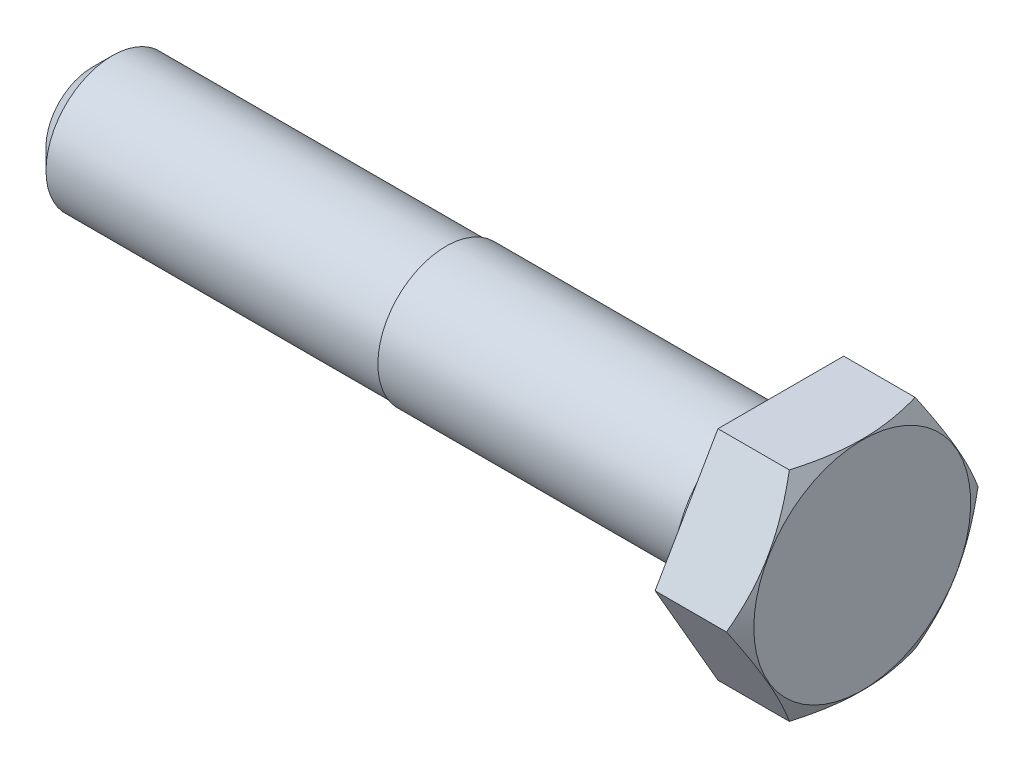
ISO-10303-21;
HEADER;
FILE_DESCRIPTION(('STEP AP214'),'2;1');
FILE_NAME('part.step','',(''),(''),'','','');
FILE_SCHEMA(('AUTOMOTIVE_DESIGN { 1 0 10303 214 1 1 1 1 }'));
ENDSEC;
DATA;
#1=APPLICATION_CONTEXT('core data for automotive mechanical design processes');
#2=APPLICATION_PROTOCOL_DEFINITION('international standard','automotive_design',2000,#1);
#3=PRODUCT_CONTEXT('',#1,'mechanical');
#4=PRODUCT('Part','Part','',(#3));
#5=PRODUCT_RELATED_PRODUCT_CATEGORY('part','',(#4));
#6=PRODUCT_DEFINITION_FORMATION('','',#4);
#7=PRODUCT_DEFINITION_CONTEXT('part definition',#1,'design');
#8=PRODUCT_DEFINITION('design','',#6,#7);
#9=PRODUCT_DEFINITION_SHAPE('','',#8);
#10=(LENGTH_UNIT() NAMED_UNIT(*) SI_UNIT(.MILLI.,.METRE.));
#11=(NAMED_UNIT(*) PLANE_ANGLE_UNIT() SI_UNIT($,.RADIAN.));
#12=(NAMED_UNIT(*) SI_UNIT($,.STERADIAN.) SOLID_ANGLE_UNIT());
#13=UNCERTAINTY_MEASURE_WITH_UNIT(LENGTH_MEASURE(1.E-05),#10,'distance_accuracy_value','');
#14=(GEOMETRIC_REPRESENTATION_CONTEXT(3) GLOBAL_UNCERTAINTY_ASSIGNED_CONTEXT((#13)) GLOBAL_UNIT_ASSIGNED_CONTEXT((#10,
#11,#12)) REPRESENTATION_CONTEXT('',''));
#15=CARTESIAN_POINT('',(0.,0.,0.));
#16=DIRECTION('',(0.,0.,1.));
#17=DIRECTION('',(1.,0.,0.));
#18=AXIS2_PLACEMENT_3D('',#15,#16,#17);
#19=CARTESIAN_POINT('',(6.58,0.,0.));
#20=DIRECTION('',(1.,0.,0.));
#21=DIRECTION('',(0.,0.,-1.));
#22=AXIS2_PLACEMENT_3D('',#19,#20,#21);
#23=PLANE('',#22);
#24=CARTESIAN_POINT('',(6.58000000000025,0.,0.));
#25=DIRECTION('',(-1.,0.,0.));
#26=DIRECTION('',(0.,0.,1.));
#27=AXIS2_PLACEMENT_3D('',#24,#25,#26);
#28=CIRCLE('',#27,7.96416127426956);
#29=CARTESIAN_POINT('',(6.58000000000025,0.,7.96416127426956));
#30=VERTEX_POINT('',#29);
#31=EDGE_CURVE('E85',#30,#30,#28,.T.);
#32=ORIENTED_EDGE('',*,*,#31,.F.);
#33=EDGE_LOOP('',(#32));
#34=FACE_BOUND('',#33,.T.);
#35=ADVANCED_FACE('F16',(#34),#23,.T.);
#36=CARTESIAN_POINT('',(5.84036598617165,0.,0.));
#37=DIRECTION('',(-1.,0.,0.));
#38=DIRECTION('',(0.,0.,1.));
#39=AXIS2_PLACEMENT_3D('',#36,#37,#38);
#40=CONICAL_SURFACE('',#39,9.24524496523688,1.0471975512);
#41=ORIENTED_EDGE('',*,*,#31,.T.);
#42=EDGE_LOOP('',(#41));
#43=FACE_BOUND('',#42,.T.);
#44=CARTESIAN_POINT('',(5.84477732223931,-1.71278036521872E-12,-9.23760430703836));
#45=CARTESIAN_POINT('',(5.94979165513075,-0.315055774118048,-9.05570677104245));
#46=CARTESIAN_POINT('',(6.04630304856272,-0.632460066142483,-8.87245331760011));
#47=CARTESIAN_POINT('',(6.21805198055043,-1.27221617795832,-8.50308995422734));
#48=CARTESIAN_POINT('',(6.29324487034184,-1.59457691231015,-8.31697489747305));
#49=CARTESIAN_POINT('',(6.41622401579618,-2.2359286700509,-7.946690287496));
#50=CARTESIAN_POINT('',(6.46458569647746,-2.5548337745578,-7.76257033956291));
#51=CARTESIAN_POINT('',(6.51588451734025,-3.03469904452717,-7.48551999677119));
#52=CARTESIAN_POINT('',(6.52944237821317,-3.19484385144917,-7.39306034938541));
#53=CARTESIAN_POINT('',(6.5492482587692,-3.51546832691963,-7.20794772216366));
#54=CARTESIAN_POINT('',(6.55549683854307,-3.67594796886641,-7.11529475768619));
#55=CARTESIAN_POINT('',(6.56075664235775,-4.0103014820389,-6.92225566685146));
#56=CARTESIAN_POINT('',(6.55912510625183,-4.18418310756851,-6.82186506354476));
#57=CARTESIAN_POINT('',(6.54717075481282,-4.53172322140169,-6.62121268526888));
#58=CARTESIAN_POINT('',(6.53684775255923,-4.70538170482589,-6.5209509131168));
#59=CARTESIAN_POINT('',(6.50774077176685,-5.05235452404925,-6.32062606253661));
#60=CARTESIAN_POINT('',(6.48894759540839,-5.22566827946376,-6.22056331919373));
#61=CARTESIAN_POINT('',(6.44332878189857,-5.57150185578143,-6.0208962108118));
#62=CARTESIAN_POINT('',(6.41650247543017,-5.74402160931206,-5.92129188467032));
#63=CARTESIAN_POINT('',(6.32328511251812,-6.26854051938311,-5.6184607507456));
#64=CARTESIAN_POINT('',(6.24490938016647,-6.61898300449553,-5.41613268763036));
#65=CARTESIAN_POINT('',(6.10811478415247,-7.14030011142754,-5.11515011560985));
#66=CARTESIAN_POINT('',(6.05937070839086,-7.31317449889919,-5.01534104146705));
#67=CARTESIAN_POINT('',(5.95617990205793,-7.65757214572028,-4.81650296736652));
#68=CARTESIAN_POINT('',(5.90173542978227,-7.82909591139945,-4.71747367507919));
#69=CARTESIAN_POINT('',(5.84477732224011,-8.00000000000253,-4.61880215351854));
#70=B_SPLINE_CURVE_WITH_KNOTS('',3,(#44,#45,#46,#47,#48,#49,#50,#51,#52,#53,#54,#55,#56,#57,#58,
#59,#60,#61,#62,#63,#64,#65,#66,#67,#68,#69),.UNSPECIFIED.,.F.,.F.,(4,2,2,2,2,2,2,2,2,2,2,2,4),
(0.,1.13620772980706,2.2747778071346,3.38787966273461,3.94400525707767,4.50008823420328,
5.10225977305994,5.70444426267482,6.30728424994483,6.910174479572,8.14546238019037,
8.76185434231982,9.37800302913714),.UNSPECIFIED.);
#71=CARTESIAN_POINT('',(5.84477732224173,-8.53704943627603E-13,-9.23760430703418));
#72=VERTEX_POINT('',#71);
#73=CARTESIAN_POINT('',(5.84477732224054,-8.,-4.61880215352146));
#74=VERTEX_POINT('',#73);
#75=EDGE_CURVE('E126',#72,#74,#70,.T.);
#76=ORIENTED_EDGE('',*,*,#75,.F.);
#77=CARTESIAN_POINT('',(5.84477732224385,7.99999999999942,-4.61880215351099));
#78=CARTESIAN_POINT('',(5.90338169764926,7.82415290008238,-4.72032752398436));
#79=CARTESIAN_POINT('',(5.95932618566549,7.64765018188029,-4.82223141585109));
#80=CARTESIAN_POINT('',(6.06516280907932,7.29321133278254,-5.02686678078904));
#81=CARTESIAN_POINT('',(6.11505233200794,7.11527461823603,-5.12959859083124));
#82=CARTESIAN_POINT('',(6.25465902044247,6.57861566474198,-5.43943878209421));
#83=CARTESIAN_POINT('',(6.33406438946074,6.21777505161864,-5.64777020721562));
#84=CARTESIAN_POINT('',(6.42717459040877,5.67778408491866,-5.95953413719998));
#85=CARTESIAN_POINT('',(6.45369860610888,5.50024680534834,-6.06203533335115));
#86=CARTESIAN_POINT('',(6.4981739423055,5.14436946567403,-6.2675012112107));
#87=CARTESIAN_POINT('',(6.51612602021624,4.96602947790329,-6.37046585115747));
#88=CARTESIAN_POINT('',(6.54300251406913,4.60904251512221,-6.57657237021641));
#89=CARTESIAN_POINT('',(6.55193717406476,4.43039611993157,-6.67971391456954));
#90=CARTESIAN_POINT('',(6.56058729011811,4.0729384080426,-6.88609222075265));
#91=CARTESIAN_POINT('',(6.56030303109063,3.89412709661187,-6.98932897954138));
#92=CARTESIAN_POINT('',(6.55115729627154,3.55984569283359,-7.18232643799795));
#93=CARTESIAN_POINT('',(6.54341147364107,3.40435198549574,-7.2721007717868));
#94=CARTESIAN_POINT('',(6.52109880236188,3.09372877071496,-7.45143916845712));
#95=CARTESIAN_POINT('',(6.50653149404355,2.93859928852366,-7.54100321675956));
#96=CARTESIAN_POINT('',(6.45294161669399,2.47381144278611,-7.80934860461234));
#97=CARTESIAN_POINT('',(6.40403778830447,2.16497575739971,-7.98765497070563));
#98=CARTESIAN_POINT('',(6.28177990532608,1.54402881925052,-8.34615885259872));
#99=CARTESIAN_POINT('',(6.20790770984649,1.23199679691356,-8.52631062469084));
#100=CARTESIAN_POINT('',(6.0402493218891,0.612585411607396,-8.88392795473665));
#101=CARTESIAN_POINT('',(5.94650249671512,0.3051981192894,-9.06139809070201));
#102=CARTESIAN_POINT('',(5.84477732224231,-5.49950815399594E-12,-9.23760430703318));
#103=B_SPLINE_CURVE_WITH_KNOTS('',3,(#77,#78,#79,#80,#81,#82,#83,#84,#85,#86,#87,#88,#89,#90,
#91,#92,#93,#94,#95,#96,#97,#98,#99,#100,#101,#102),.UNSPECIFIED.,.F.,.F.,(4,2,2,2,2,2,2,2,2,2,
2,2,4),(0.,0.633965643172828,1.26820385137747,2.5393150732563,3.15930423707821,3.77923860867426,
4.39846792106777,5.01767809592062,5.55669078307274,6.09573979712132,7.17460544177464,
8.27739515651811,9.37802056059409),.UNSPECIFIED.);
#104=CARTESIAN_POINT('',(5.84477732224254,7.99999999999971,-4.61880215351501));
#105=VERTEX_POINT('',#104);
#106=EDGE_CURVE('E81',#105,#72,#103,.T.);
#107=ORIENTED_EDGE('',*,*,#106,.F.);
#108=CARTESIAN_POINT('',(5.84477732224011,8.,4.61880215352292));
#109=CARTESIAN_POINT('',(5.90338169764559,8.,4.41575141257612));
#110=CARTESIAN_POINT('',(5.95932618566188,8.,4.21194362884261));
#111=CARTESIAN_POINT('',(6.06516280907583,8.,3.8026728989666));
#112=CARTESIAN_POINT('',(6.11505233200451,8.,3.59720927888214));
#113=CARTESIAN_POINT('',(6.25465902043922,8.,2.97752889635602));
#114=CARTESIAN_POINT('',(6.33406438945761,8.,2.56086604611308));
#115=CARTESIAN_POINT('',(6.4271745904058,8.,1.93733818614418));
#116=CARTESIAN_POINT('',(6.45369860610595,8.,1.73233579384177));
#117=CARTESIAN_POINT('',(6.49817394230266,8.,1.32140403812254));
#118=CARTESIAN_POINT('',(6.51612602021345,8.,1.11547475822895));
#119=CARTESIAN_POINT('',(6.54300251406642,8.,0.703261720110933));
#120=CARTESIAN_POINT('',(6.55193717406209,8.,0.496978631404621));
#121=CARTESIAN_POINT('',(6.5605872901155,8.,0.0842220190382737));
#122=CARTESIAN_POINT('',(6.56030303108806,8.,-0.12225149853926));
#123=CARTESIAN_POINT('',(6.55115729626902,8.,-0.508246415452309));
#124=CARTESIAN_POINT('',(6.54341147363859,8.,-0.687795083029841));
#125=CARTESIAN_POINT('',(6.52109880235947,8.,-1.04647187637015));
#126=CARTESIAN_POINT('',(6.50653149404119,8.,-1.22559997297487));
#127=CARTESIAN_POINT('',(6.45294161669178,8.,-1.76229074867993));
#128=CARTESIAN_POINT('',(6.40403778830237,8.,-2.11890348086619));
#129=CARTESIAN_POINT('',(6.28177990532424,8.,-2.83591124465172));
#130=CARTESIAN_POINT('',(6.2079077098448,8.,-3.19621478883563));
#131=CARTESIAN_POINT('',(6.04024932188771,8.,-3.91144944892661));
#132=CARTESIAN_POINT('',(5.94650249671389,8.,-4.26638972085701));
#133=CARTESIAN_POINT('',(5.84477732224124,8.,-4.61880215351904));
#134=B_SPLINE_CURVE_WITH_KNOTS('',3,(#108,#109,#110,#111,#112,#113,#114,#115,#116,#117,#118,
#119,#120,#121,#122,#123,#124,#125,#126,#127,#128,#129,#130,#131,#132,#133),.UNSPECIFIED.,.F.,
.F.,(4,2,2,2,2,2,2,2,2,2,2,2,4),(0.,0.633965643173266,1.26820385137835,2.53931507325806,
3.15930423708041,3.77923860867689,4.39846792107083,5.01767809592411,5.55669078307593,
6.09573979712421,7.17460544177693,8.27739515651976,9.3780205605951),.UNSPECIFIED.);
#135=CARTESIAN_POINT('',(5.84477732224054,8.,4.61880215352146));
#136=VERTEX_POINT('',#135);
#137=EDGE_CURVE('E74',#136,#105,#134,.T.);
#138=ORIENTED_EDGE('',*,*,#137,.F.);
#139=CARTESIAN_POINT('',(5.84477732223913,1.15719547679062E-12,9.23760430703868));
#140=CARTESIAN_POINT('',(5.94979165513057,0.315055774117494,9.05570677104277));
#141=CARTESIAN_POINT('',(6.04630304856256,0.632460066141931,8.87245331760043));
#142=CARTESIAN_POINT('',(6.2180519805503,1.27221617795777,8.50308995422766));
#143=CARTESIAN_POINT('',(6.29324487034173,1.59457691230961,8.31697489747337));
#144=CARTESIAN_POINT('',(6.41622401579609,2.23592867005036,7.94669028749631));
#145=CARTESIAN_POINT('',(6.46458569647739,2.55483377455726,7.76257033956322));
#146=CARTESIAN_POINT('',(6.5158845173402,3.03469904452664,7.4855199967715));
#147=CARTESIAN_POINT('',(6.52944237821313,3.19484385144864,7.39306034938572));
#148=CARTESIAN_POINT('',(6.54924825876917,3.51546832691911,7.20794772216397));
#149=CARTESIAN_POINT('',(6.55549683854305,3.67594796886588,7.1152947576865));
#150=CARTESIAN_POINT('',(6.56075664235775,4.0103014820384,6.92225566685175));
#151=CARTESIAN_POINT('',(6.55912510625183,4.18418310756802,6.82186506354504));
#152=CARTESIAN_POINT('',(6.54717075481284,4.53172322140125,6.62121268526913));
#153=CARTESIAN_POINT('',(6.53684775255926,4.70538170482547,6.52095091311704));
#154=CARTESIAN_POINT('',(6.50774077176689,5.05235452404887,6.32062606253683));
#155=CARTESIAN_POINT('',(6.48894759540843,5.2256682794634,6.22056331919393));
#156=CARTESIAN_POINT('',(6.44332878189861,5.57150185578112,6.02089621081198));
#157=CARTESIAN_POINT('',(6.41650247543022,5.74402160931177,5.92129188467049));
#158=CARTESIAN_POINT('',(6.32328511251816,6.26854051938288,5.61846075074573));
#159=CARTESIAN_POINT('',(6.24490938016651,6.61898300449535,5.41613268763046));
#160=CARTESIAN_POINT('',(6.1081147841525,7.14030011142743,5.11515011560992));
#161=CARTESIAN_POINT('',(6.05937070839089,7.31317449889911,5.0153410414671));
#162=CARTESIAN_POINT('',(5.95617990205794,7.65757214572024,4.81650296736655));
#163=CARTESIAN_POINT('',(5.90173542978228,7.82909591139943,4.7174736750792));
#164=CARTESIAN_POINT('',(5.84477732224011,8.00000000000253,4.61880215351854));
#165=B_SPLINE_CURVE_WITH_KNOTS('',3,(#139,#140,#141,#142,#143,#144,#145,#146,#147,#148,#149,
#150,#151,#152,#153,#154,#155,#156,#157,#158,#159,#160,#161,#162,#163,#164),.UNSPECIFIED.,.F.,
.F.,(4,2,2,2,2,2,2,2,2,2,2,2,4),(0.,1.13620772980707,2.27477780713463,3.38787966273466,
3.94400525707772,4.50008823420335,5.10225977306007,5.70444426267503,6.30728424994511,
6.91017447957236,8.14546238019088,8.76185434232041,9.37800302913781),.UNSPECIFIED.);
#166=CARTESIAN_POINT('',(5.84477732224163,5.7958640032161E-13,9.23760430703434));
#167=VERTEX_POINT('',#166);
#168=EDGE_CURVE('E78',#167,#136,#165,.T.);
#169=ORIENTED_EDGE('',*,*,#168,.F.);
#170=CARTESIAN_POINT('',(5.84477732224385,-7.99999999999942,4.61880215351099));
#171=CARTESIAN_POINT('',(5.90338169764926,-7.82415290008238,4.72032752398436));
#172=CARTESIAN_POINT('',(5.95932618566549,-7.64765018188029,4.82223141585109));
#173=CARTESIAN_POINT('',(6.06516280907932,-7.29321133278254,5.02686678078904));
#174=CARTESIAN_POINT('',(6.11505233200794,-7.11527461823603,5.12959859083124));
#175=CARTESIAN_POINT('',(6.25465902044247,-6.57861566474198,5.43943878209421));
#176=CARTESIAN_POINT('',(6.33406438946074,-6.21777505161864,5.64777020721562));
#177=CARTESIAN_POINT('',(6.42717459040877,-5.67778408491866,5.95953413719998));
#178=CARTESIAN_POINT('',(6.45369860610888,-5.50024680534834,6.06203533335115));
#179=CARTESIAN_POINT('',(6.4981739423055,-5.14436946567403,6.2675012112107));
#180=CARTESIAN_POINT('',(6.51612602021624,-4.96602947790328,6.37046585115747));
#181=CARTESIAN_POINT('',(6.54300251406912,-4.60904251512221,6.57657237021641));
#182=CARTESIAN_POINT('',(6.55193717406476,-4.43039611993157,6.67971391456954));
#183=CARTESIAN_POINT('',(6.56058729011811,-4.0729384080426,6.88609222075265));
#184=CARTESIAN_POINT('',(6.56030303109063,-3.89412709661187,6.98932897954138));
#185=CARTESIAN_POINT('',(6.55115729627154,-3.55984569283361,7.18232643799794));
#186=CARTESIAN_POINT('',(6.54341147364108,-3.40435198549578,7.27210077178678));
#187=CARTESIAN_POINT('',(6.52109880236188,-3.09372877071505,7.45143916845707));
#188=CARTESIAN_POINT('',(6.50653149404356,-2.93859928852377,7.5410032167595));
#189=CARTESIAN_POINT('',(6.45294161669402,-2.4738114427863,7.80934860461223));
#190=CARTESIAN_POINT('',(6.40403778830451,-2.16497575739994,7.9876549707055));
#191=CARTESIAN_POINT('',(6.28177990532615,-1.54402881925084,8.34615885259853));
#192=CARTESIAN_POINT('',(6.20790770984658,-1.23199679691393,8.52631062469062));
#193=CARTESIAN_POINT('',(6.04024932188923,-0.612585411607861,8.88392795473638));
#194=CARTESIAN_POINT('',(5.94650249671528,-0.305198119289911,9.06139809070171));
#195=CARTESIAN_POINT('',(5.84477732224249,4.94435617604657E-12,9.23760430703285));
#196=B_SPLINE_CURVE_WITH_KNOTS('',3,(#170,#171,#172,#173,#174,#175,#176,#177,#178,#179,#180,
#181,#182,#183,#184,#185,#186,#187,#188,#189,#190,#191,#192,#193,#194,#195),.UNSPECIFIED.,.F.,
.F.,(4,2,2,2,2,2,2,2,2,2,2,2,4),(0.,0.633965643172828,1.26820385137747,2.5393150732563,
3.15930423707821,3.77923860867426,4.39846792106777,5.01767809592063,5.55669078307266,
6.09573979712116,7.17460544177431,8.27739515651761,9.37802056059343),.UNSPECIFIED.);
#197=CARTESIAN_POINT('',(5.8447773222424,-7.99999999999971,4.6188021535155));
#198=VERTEX_POINT('',#197);
#199=EDGE_CURVE('E99',#198,#167,#196,.T.);
#200=ORIENTED_EDGE('',*,*,#199,.F.);
#201=CARTESIAN_POINT('',(5.84477732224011,-8.,-4.61880215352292));
#202=CARTESIAN_POINT('',(5.90338169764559,-8.,-4.41575141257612));
#203=CARTESIAN_POINT('',(5.95932618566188,-8.,-4.21194362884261));
#204=CARTESIAN_POINT('',(6.06516280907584,-8.,-3.8026728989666));
#205=CARTESIAN_POINT('',(6.11505233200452,-8.,-3.59720927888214));
#206=CARTESIAN_POINT('',(6.25465902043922,-8.,-2.97752889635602));
#207=CARTESIAN_POINT('',(6.33406438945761,-8.,-2.56086604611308));
#208=CARTESIAN_POINT('',(6.4271745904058,-8.,-1.93733818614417));
#209=CARTESIAN_POINT('',(6.45369860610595,-8.,-1.73233579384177));
#210=CARTESIAN_POINT('',(6.49817394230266,-8.,-1.32140403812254));
#211=CARTESIAN_POINT('',(6.51612602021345,-8.,-1.11547475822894));
#212=CARTESIAN_POINT('',(6.54300251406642,-8.,-0.703261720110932));
#213=CARTESIAN_POINT('',(6.55193717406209,-8.,-0.49697863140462));
#214=CARTESIAN_POINT('',(6.5605872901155,-8.,-0.0842220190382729));
#215=CARTESIAN_POINT('',(6.56030303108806,-8.,0.122251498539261));
#216=CARTESIAN_POINT('',(6.55115729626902,-8.,0.508246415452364));
#217=CARTESIAN_POINT('',(6.54341147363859,-8.,0.687795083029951));
#218=CARTESIAN_POINT('',(6.52109880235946,-8.,1.04647187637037));
#219=CARTESIAN_POINT('',(6.50653149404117,-8.,1.22559997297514));
#220=CARTESIAN_POINT('',(6.45294161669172,-8.,1.76229074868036));
#221=CARTESIAN_POINT('',(6.4040377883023,-8.,2.11890348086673));
#222=CARTESIAN_POINT('',(6.2817799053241,-8.,2.83591124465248));
#223=CARTESIAN_POINT('',(6.20790770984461,-8.,3.1962147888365));
#224=CARTESIAN_POINT('',(6.04024932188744,-8.,3.9114494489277));
#225=CARTESIAN_POINT('',(5.94650249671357,-8.,4.2663897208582));
#226=CARTESIAN_POINT('',(5.84477732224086,-8.,4.61880215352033));
#227=B_SPLINE_CURVE_WITH_KNOTS('',3,(#201,#202,#203,#204,#205,#206,#207,#208,#209,#210,#211,
#212,#213,#214,#215,#216,#217,#218,#219,#220,#221,#222,#223,#224,#225,#226),.UNSPECIFIED.,.F.,
.F.,(4,2,2,2,2,2,2,2,2,2,2,2,4),(0.,0.633965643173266,1.26820385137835,2.53931507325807,
3.15930423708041,3.77923860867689,4.39846792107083,5.01767809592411,5.55669078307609,
6.09573979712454,7.17460544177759,8.27739515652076,9.37802056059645),.UNSPECIFIED.);
#228=EDGE_CURVE('E133',#74,#198,#227,.T.);
#229=ORIENTED_EDGE('',*,*,#228,.F.);
#230=EDGE_LOOP('',(#76,#107,#138,#169,#200,#229));
#231=FACE_BOUND('',#230,.T.);
#232=ADVANCED_FACE('F76',(#43,#231),#40,.T.);
#233=CARTESIAN_POINT('',(0.6,8.,-4.61880215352));
#234=DIRECTION('',(0.,1.,0.));
#235=DIRECTION('',(0.,0.,1.));
#236=AXIS2_PLACEMENT_3D('',#233,#234,#235);
#237=PLANE('',#236);
#238=DIRECTION('',(1.,0.,0.));
#239=VECTOR('',#238,1.);
#240=CARTESIAN_POINT('',(0.6,8.,4.61880215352));
#241=LINE('',#240,#239);
#242=CARTESIAN_POINT('',(0.6,8.,4.61880215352));
#243=VERTEX_POINT('',#242);
#244=EDGE_CURVE('E84',#136,#243,#241,.F.);
#245=ORIENTED_EDGE('',*,*,#244,.F.);
#246=ORIENTED_EDGE('',*,*,#137,.T.);
#247=DIRECTION('',(1.,0.,0.));
#248=VECTOR('',#247,1.);
#249=CARTESIAN_POINT('',(0.6,7.99999999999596,-4.61880215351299));
#250=LINE('',#249,#248);
#251=CARTESIAN_POINT('',(0.6,7.99999999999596,-4.61880215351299));
#252=VERTEX_POINT('',#251);
#253=EDGE_CURVE('E143',#252,#105,#250,.T.);
#254=ORIENTED_EDGE('',*,*,#253,.F.);
#255=DIRECTION('',(0.,0.,-1.));
#256=VECTOR('',#255,1.);
#257=CARTESIAN_POINT('',(0.6,8.,0.));
#258=LINE('',#257,#256);
#259=EDGE_CURVE('E90',#252,#243,#258,.F.);
#260=ORIENTED_EDGE('',*,*,#259,.T.);
#261=EDGE_LOOP('',(#245,#246,#254,#260));
#262=FACE_BOUND('',#261,.T.);
#263=ADVANCED_FACE('F88',(#262),#237,.T.);
#264=CARTESIAN_POINT('',(0.6,8.,4.61880215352));
#265=DIRECTION('',(0.,0.50000000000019,0.866025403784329));
#266=DIRECTION('',(0.,-0.866025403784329,0.50000000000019));
#267=AXIS2_PLACEMENT_3D('',#264,#265,#266);
#268=PLANE('',#267);
#269=DIRECTION('',(1.,0.,0.));
#270=VECTOR('',#269,1.);
#271=CARTESIAN_POINT('',(0.6,0.,9.23760430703));
#272=LINE('',#271,#270);
#273=CARTESIAN_POINT('',(0.6,1.51894184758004E-12,9.23760430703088));
#274=VERTEX_POINT('',#273);
#275=EDGE_CURVE('E96',#167,#274,#272,.F.);
#276=ORIENTED_EDGE('',*,*,#275,.F.);
#277=ORIENTED_EDGE('',*,*,#168,.T.);
#278=ORIENTED_EDGE('',*,*,#244,.T.);
#279=DIRECTION('',(0.,-0.866025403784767,0.499999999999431));
#280=VECTOR('',#279,1.);
#281=CARTESIAN_POINT('',(0.6,8.,4.61880215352));
#282=LINE('',#281,#280);
#283=EDGE_CURVE('E265',#243,#274,#282,.T.);
#284=ORIENTED_EDGE('',*,*,#283,.T.);
#285=EDGE_LOOP('',(#276,#277,#278,#284));
#286=FACE_BOUND('',#285,.T.);
#287=ADVANCED_FACE('F94',(#286),#268,.T.);
#288=CARTESIAN_POINT('',(0.6,0.,9.23760430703));
#289=DIRECTION('',(0.,-0.50000000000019,0.866025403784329));
#290=DIRECTION('',(0.,-0.866025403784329,-0.50000000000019));
#291=AXIS2_PLACEMENT_3D('',#288,#289,#290);
#292=PLANE('',#291);
#293=DIRECTION('',(1.,0.,0.));
#294=VECTOR('',#293,1.);
#295=CARTESIAN_POINT('',(0.6,-8.,4.61880215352));
#296=LINE('',#295,#294);
#297=CARTESIAN_POINT('',(0.6,-8.,4.61880215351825));
#298=VERTEX_POINT('',#297);
#299=EDGE_CURVE('E249',#198,#298,#296,.F.);
#300=ORIENTED_EDGE('',*,*,#299,.F.);
#301=ORIENTED_EDGE('',*,*,#199,.T.);
#302=ORIENTED_EDGE('',*,*,#275,.T.);
#303=DIRECTION('',(0.,-0.866025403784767,-0.499999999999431));
#304=VECTOR('',#303,1.);
#305=CARTESIAN_POINT('',(0.6,0.,9.23760430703));
#306=LINE('',#305,#304);
#307=EDGE_CURVE('E273',#274,#298,#306,.T.);
#308=ORIENTED_EDGE('',*,*,#307,.T.);
#309=EDGE_LOOP('',(#300,#301,#302,#308));
#310=FACE_BOUND('',#309,.T.);
#311=ADVANCED_FACE('F160',(#310),#292,.T.);
#312=CARTESIAN_POINT('',(0.6,-8.,4.61880215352));
#313=DIRECTION('',(0.,-1.,0.));
#314=DIRECTION('',(0.,0.,-1.));
#315=AXIS2_PLACEMENT_3D('',#312,#313,#314);
#316=PLANE('',#315);
#317=DIRECTION('',(1.,0.,0.));
#318=VECTOR('',#317,1.);
#319=CARTESIAN_POINT('',(0.6,-8.,-4.61880215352));
#320=LINE('',#319,#318);
#321=CARTESIAN_POINT('',(0.6,-8.,-4.61880215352));
#322=VERTEX_POINT('',#321);
#323=EDGE_CURVE('E244',#74,#322,#320,.F.);
#324=ORIENTED_EDGE('',*,*,#323,.F.);
#325=ORIENTED_EDGE('',*,*,#228,.T.);
#326=ORIENTED_EDGE('',*,*,#299,.T.);
#327=DIRECTION('',(0.,0.,-1.));
#328=VECTOR('',#327,1.);
#329=CARTESIAN_POINT('',(0.6,-8.,0.));
#330=LINE('',#329,#328);
#331=EDGE_CURVE('E269',#298,#322,#330,.T.);
#332=ORIENTED_EDGE('',*,*,#331,.T.);
#333=EDGE_LOOP('',(#324,#325,#326,#332));
#334=FACE_BOUND('',#333,.T.);
#335=ADVANCED_FACE('F156',(#334),#316,.T.);
#336=CARTESIAN_POINT('',(0.6,-8.,-4.61880215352));
#337=DIRECTION('',(0.,-0.50000000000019,-0.866025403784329));
#338=DIRECTION('',(0.,0.866025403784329,-0.50000000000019));
#339=AXIS2_PLACEMENT_3D('',#336,#337,#338);
#340=PLANE('',#339);
#341=DIRECTION('',(1.,0.,0.));
#342=VECTOR('',#341,1.);
#343=CARTESIAN_POINT('',(0.6,0.,-9.23760430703));
#344=LINE('',#343,#342);
#345=CARTESIAN_POINT('',(0.6,-1.51257229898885E-12,-9.23760430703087));
#346=VERTEX_POINT('',#345);
#347=EDGE_CURVE('E237',#72,#346,#344,.F.);
#348=ORIENTED_EDGE('',*,*,#347,.F.);
#349=ORIENTED_EDGE('',*,*,#75,.T.);
#350=ORIENTED_EDGE('',*,*,#323,.T.);
#351=DIRECTION('',(0.,0.866025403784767,-0.499999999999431));
#352=VECTOR('',#351,1.);
#353=CARTESIAN_POINT('',(0.6,-8.,-4.61880215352));
#354=LINE('',#353,#352);
#355=EDGE_CURVE('E261',#322,#346,#354,.T.);
#356=ORIENTED_EDGE('',*,*,#355,.T.);
#357=EDGE_LOOP('',(#348,#349,#350,#356));
#358=FACE_BOUND('',#357,.T.);
#359=ADVANCED_FACE('F151',(#358),#340,.T.);
#360=CARTESIAN_POINT('',(0.6,0.,-9.23760430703));
#361=DIRECTION('',(0.,0.50000000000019,-0.866025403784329));
#362=DIRECTION('',(0.,0.866025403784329,0.50000000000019));
#363=AXIS2_PLACEMENT_3D('',#360,#361,#362);
#364=PLANE('',#363);
#365=ORIENTED_EDGE('',*,*,#253,.T.);
#366=ORIENTED_EDGE('',*,*,#106,.T.);
#367=ORIENTED_EDGE('',*,*,#347,.T.);
#368=DIRECTION('',(0.,0.866025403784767,0.499999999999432));
#369=VECTOR('',#368,1.);
#370=CARTESIAN_POINT('',(0.6,0.,-9.23760430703));
#371=LINE('',#370,#369);
#372=EDGE_CURVE('E258',#346,#252,#371,.T.);
#373=ORIENTED_EDGE('',*,*,#372,.T.);
#374=EDGE_LOOP('',(#365,#366,#367,#373));
#375=FACE_BOUND('',#374,.T.);
#376=ADVANCED_FACE('F146',(#375),#364,.T.);
#377=CARTESIAN_POINT('',(0.6,0.,0.));
#378=DIRECTION('',(1.,0.,0.));
#379=DIRECTION('',(0.,0.,-1.));
#380=AXIS2_PLACEMENT_3D('',#377,#378,#379);
#381=PLANE('',#380);
#382=CARTESIAN_POINT('',(0.6,0.,0.));
#383=DIRECTION('',(1.,0.,0.));
#384=DIRECTION('',(0.,0.,-1.));
#385=AXIS2_PLACEMENT_3D('',#382,#383,#384);
#386=CIRCLE('',#385,7.315);
#387=CARTESIAN_POINT('',(0.6,0.,-7.315));
#388=VERTEX_POINT('',#387);
#389=EDGE_CURVE('E144',#388,#388,#386,.F.);
#390=ORIENTED_EDGE('',*,*,#389,.F.);
#391=EDGE_LOOP('',(#390));
#392=FACE_BOUND('',#391,.T.);
#393=ORIENTED_EDGE('',*,*,#355,.F.);
#394=ORIENTED_EDGE('',*,*,#331,.F.);
#395=ORIENTED_EDGE('',*,*,#307,.F.);
#396=ORIENTED_EDGE('',*,*,#283,.F.);
#397=ORIENTED_EDGE('',*,*,#259,.F.);
#398=ORIENTED_EDGE('',*,*,#372,.F.);
#399=EDGE_LOOP('',(#393,#394,#395,#396,#397,#398));
#400=FACE_BOUND('',#399,.T.);
#401=ADVANCED_FACE('F150',(#392,#400),#381,.F.);
#402=CARTESIAN_POINT('',(0.3,0.,0.));
#403=DIRECTION('',(1.,0.,0.));
#404=DIRECTION('',(0.,0.,-1.));
#405=AXIS2_PLACEMENT_3D('',#402,#403,#404);
#406=CYLINDRICAL_SURFACE('',#405,7.315);
#407=CARTESIAN_POINT('',(0.,0.,0.));
#408=DIRECTION('',(1.,0.,0.));
#409=DIRECTION('',(0.,0.,-1.));
#410=AXIS2_PLACEMENT_3D('',#407,#408,#409);
#411=CIRCLE('',#410,7.315);
#412=CARTESIAN_POINT('',(0.,0.,-7.315));
#413=VERTEX_POINT('',#412);
#414=EDGE_CURVE('E287',#413,#413,#411,.T.);
#415=ORIENTED_EDGE('',*,*,#414,.T.);
#416=EDGE_LOOP('',(#415));
#417=FACE_BOUND('',#416,.T.);
#418=ORIENTED_EDGE('',*,*,#389,.T.);
#419=EDGE_LOOP('',(#418));
#420=FACE_BOUND('',#419,.T.);
#421=ADVANCED_FACE('F294',(#417,#420),#406,.T.);
#422=CARTESIAN_POINT('',(0.,0.,0.));
#423=DIRECTION('',(1.,0.,0.));
#424=DIRECTION('',(0.,0.,-1.));
#425=AXIS2_PLACEMENT_3D('',#422,#423,#424);
#426=PLANE('',#425);
#427=CARTESIAN_POINT('',(0.,0.,0.));
#428=DIRECTION('',(-1.,0.,0.));
#429=DIRECTION('',(0.,-1.,0.));
#430=AXIS2_PLACEMENT_3D('',#427,#428,#429);
#431=CIRCLE('',#430,5.40000000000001);
#432=CARTESIAN_POINT('',(0.,5.40000000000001,0.));
#433=VERTEX_POINT('',#432);
#434=CARTESIAN_POINT('',(0.,-5.4,0.));
#435=VERTEX_POINT('',#434);
#436=EDGE_CURVE('E211',#433,#435,#431,.F.);
#437=ORIENTED_EDGE('',*,*,#436,.T.);
#438=CARTESIAN_POINT('',(0.,0.,0.));
#439=DIRECTION('',(-1.,0.,0.));
#440=DIRECTION('',(0.,1.,0.));
#441=AXIS2_PLACEMENT_3D('',#438,#439,#440);
#442=CIRCLE('',#441,5.40000000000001);
#443=EDGE_CURVE('E35',#435,#433,#442,.F.);
#444=ORIENTED_EDGE('',*,*,#443,.T.);
#445=EDGE_LOOP('',(#437,#444));
#446=FACE_BOUND('',#445,.T.);
#447=ORIENTED_EDGE('',*,*,#414,.F.);
#448=EDGE_LOOP('',(#447));
#449=FACE_BOUND('',#448,.T.);
#450=ADVANCED_FACE('F199',(#446,#449),#426,.F.);
#451=CARTESIAN_POINT('',(-0.4,0.,0.));
#452=DIRECTION('',(1.,0.,0.));
#453=DIRECTION('',(0.,-1.,0.));
#454=AXIS2_PLACEMENT_3D('',#451,#452,#453);
#455=TOROIDAL_SURFACE('',#454,5.4,0.4);
#456=ORIENTED_EDGE('',*,*,#443,.F.);
#457=ORIENTED_EDGE('',*,*,#436,.F.);
#458=EDGE_LOOP('',(#456,#457));
#459=FACE_BOUND('',#458,.T.);
#460=CARTESIAN_POINT('',(-0.399999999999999,0.,0.));
#461=DIRECTION('',(-1.,0.,0.));
#462=DIRECTION('',(0.,0.,1.));
#463=AXIS2_PLACEMENT_3D('',#460,#461,#462);
#464=CIRCLE('',#463,5.);
#465=CARTESIAN_POINT('',(-0.399999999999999,0.,5.));
#466=VERTEX_POINT('',#465);
#467=EDGE_CURVE('E206',#466,#466,#464,.T.);
#468=ORIENTED_EDGE('',*,*,#467,.F.);
#469=EDGE_LOOP('',(#468));
#470=FACE_BOUND('',#469,.T.);
#471=ADVANCED_FACE('F193',(#459,#470),#455,.F.);
#472=CARTESIAN_POINT('',(-12.,0.,0.));
#473=DIRECTION('',(-1.,0.,0.));
#474=DIRECTION('',(0.,0.,1.));
#475=AXIS2_PLACEMENT_3D('',#472,#473,#474);
#476=CYLINDRICAL_SURFACE('',#475,5.);
#477=CARTESIAN_POINT('',(-24.,0.,0.));
#478=DIRECTION('',(-1.,0.,0.));
#479=DIRECTION('',(0.,0.,1.));
#480=AXIS2_PLACEMENT_3D('',#477,#478,#479);
#481=CIRCLE('',#480,5.);
#482=CARTESIAN_POINT('',(-24.,0.,5.));
#483=VERTEX_POINT('',#482);
#484=EDGE_CURVE('E209',#483,#483,#481,.T.);
#485=ORIENTED_EDGE('',*,*,#484,.F.);
#486=EDGE_LOOP('',(#485));
#487=FACE_BOUND('',#486,.T.);
#488=ORIENTED_EDGE('',*,*,#467,.T.);
#489=EDGE_LOOP('',(#488));
#490=FACE_BOUND('',#489,.T.);
#491=ADVANCED_FACE('F190',(#487,#490),#476,.T.);
#492=CARTESIAN_POINT('',(-50.,0.,0.));
#493=DIRECTION('',(-1.,0.,0.));
#494=DIRECTION('',(0.,0.,1.));
#495=AXIS2_PLACEMENT_3D('',#492,#493,#494);
#496=PLANE('',#495);
#497=CARTESIAN_POINT('',(-50.0000000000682,0.,0.));
#498=DIRECTION('',(1.,0.,0.));
#499=DIRECTION('',(0.,0.,-1.));
#500=AXIS2_PLACEMENT_3D('',#497,#498,#499);
#501=CIRCLE('',#500,3.37804878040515);
#502=CARTESIAN_POINT('',(-50.0000000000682,0.,-3.37804878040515));
#503=VERTEX_POINT('',#502);
#504=EDGE_CURVE('E283',#503,#503,#501,.T.);
#505=ORIENTED_EDGE('',*,*,#504,.F.);
#506=EDGE_LOOP('',(#505));
#507=FACE_BOUND('',#506,.T.);
#508=ADVANCED_FACE('F186',(#507),#496,.T.);
#509=CARTESIAN_POINT('',(-24.,0.,0.));
#510=DIRECTION('',(-1.,0.,0.));
#511=DIRECTION('',(0.,0.,1.));
#512=AXIS2_PLACEMENT_3D('',#509,#510,#511);
#513=PLANE('',#512);
#514=CARTESIAN_POINT('',(-24.,0.,0.));
#515=DIRECTION('',(-1.,0.,0.));
#516=DIRECTION('',(0.,0.,1.));
#517=AXIS2_PLACEMENT_3D('',#514,#515,#516);
#518=CIRCLE('',#517,4.87804878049);
#519=CARTESIAN_POINT('',(-24.,0.,4.87804878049));
#520=VERTEX_POINT('',#519);
#521=EDGE_CURVE('E27',#520,#520,#518,.T.);
#522=ORIENTED_EDGE('',*,*,#521,.F.);
#523=EDGE_LOOP('',(#522));
#524=FACE_BOUND('',#523,.T.);
#525=ORIENTED_EDGE('',*,*,#484,.T.);
#526=EDGE_LOOP('',(#525));
#527=FACE_BOUND('',#526,.T.);
#528=ADVANCED_FACE('F178',(#524,#527),#513,.T.);
#529=CARTESIAN_POINT('',(-48.5000000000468,0.,0.));
#530=DIRECTION('',(1.,0.,0.));
#531=DIRECTION('',(0.,0.,-1.));
#532=AXIS2_PLACEMENT_3D('',#529,#530,#531);
#533=CONICAL_SURFACE('',#532,4.87804878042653,0.785398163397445);
#534=CARTESIAN_POINT('',(-48.5,0.,0.));
#535=DIRECTION('',(-1.,0.,0.));
#536=DIRECTION('',(0.,0.,1.));
#537=AXIS2_PLACEMENT_3D('',#534,#535,#536);
#538=CIRCLE('',#537,4.87804878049);
#539=CARTESIAN_POINT('',(-48.5,0.,4.87804878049));
#540=VERTEX_POINT('',#539);
#541=EDGE_CURVE('E11',#540,#540,#538,.F.);
#542=ORIENTED_EDGE('',*,*,#541,.F.);
#543=EDGE_LOOP('',(#542));
#544=FACE_BOUND('',#543,.T.);
#545=ORIENTED_EDGE('',*,*,#504,.T.);
#546=EDGE_LOOP('',(#545));
#547=FACE_BOUND('',#546,.T.);
#548=ADVANCED_FACE('F172',(#544,#547),#533,.T.);
#549=CARTESIAN_POINT('',(-37.,0.,0.));
#550=DIRECTION('',(-1.,0.,0.));
#551=DIRECTION('',(0.,0.,1.));
#552=AXIS2_PLACEMENT_3D('',#549,#550,#551);
#553=CYLINDRICAL_SURFACE('',#552,4.87804878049);
#554=ORIENTED_EDGE('',*,*,#521,.T.);
#555=EDGE_LOOP('',(#554));
#556=FACE_BOUND('',#555,.T.);
#557=ORIENTED_EDGE('',*,*,#541,.T.);
#558=EDGE_LOOP('',(#557));
#559=FACE_BOUND('',#558,.T.);
#560=ADVANCED_FACE('F170',(#556,#559),#553,.T.);
#561=CLOSED_SHELL('',(#35,#232,#263,#287,#311,#335,#359,#376,#401,#421,#450,#471,#491,#508,#528,
#548,#560));
#562=MANIFOLD_SOLID_BREP('B1',#561);
#563=ADVANCED_BREP_SHAPE_REPRESENTATION('',(#18,#562),#14);
#564=SHAPE_DEFINITION_REPRESENTATION(#9,#563);
ENDSEC;
END-ISO-10303-21;
